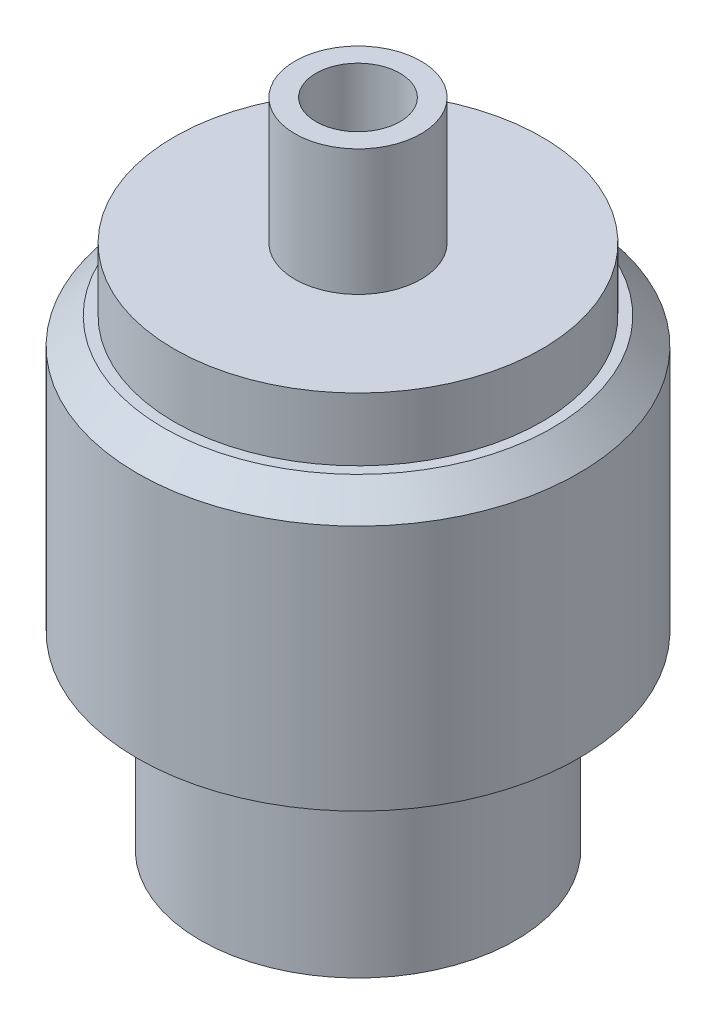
from build123d import *

# Parameters (mm, degrees)
SKICA1_R                   = 10.5
P_IDAT_VYSUNUT_M1_DEPTH    = 25
SKICA2_OUTSIDE_W           = 30.764
SKICA2_OUTSIDE_H           = 30.764
SKICA2_OUTSIDE_R           = 8.75
ODEBRAT_VYSUNUT_M1_DEPTH   = 3
SKICA3_R                   = 3
P_IDAT_VYSUNUT_M2_DEPTH    = 6
SKICA4_OUTSIDE_W           = 31.586
SKICA4_OUTSIDE_H           = 31.586
SKICA4_OUTSIDE_R           = 7.5
ODEBRAT_VYSUNUT_M2_DEPTH   = 7.5
ZKOSEN_1_SIZE              = 1.5
ZKOSEN_1_SIZE2             = 2.5
ZKOSEN_2_SIZE              = 1.25
F_7_0_7_PR_M_R_D_RY1_D     = 7
F_7_0_7_PR_M_R_D_RY1_DEPTH = 20
F_7_0_7_PR_M_R_D_RY1_TIP   = 2.020725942
SKICA7_R                   = 2
ODEBRAT_VYSUNUT_M3_DEPTH   = 35.372954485


with BuildPart() as part:
    # Skica1 → P_idat vysunut_m1 (new body)
    with BuildSketch(Plane(origin=(0, 0, 0), x_dir=(1, 0, 0), z_dir=(0, 1, 0))):
        with Locations(Location((0, 0, 0), (0, 0, 270))):
            Circle(SKICA1_R)
    extrude(amount=P_IDAT_VYSUNUT_M1_DEPTH)

    # Skica2 outside → Odebrat vysunut_m1 (cut)
    with BuildSketch(Plane(origin=(0, 25, 0), x_dir=(1, 0, 0), z_dir=(0, 1, 0))):
        Rectangle(SKICA2_OUTSIDE_W, SKICA2_OUTSIDE_H)
        with Locations(Location((0, 0, 0), (0, 0, 270))):
            Circle(SKICA2_OUTSIDE_R, mode=Mode.SUBTRACT)
    extrude(amount=-ODEBRAT_VYSUNUT_M1_DEPTH, mode=Mode.SUBTRACT)

    # Skica3 → P_idat vysunut_m2 (add)
    with BuildSketch(Plane(origin=(0, 25, 0), x_dir=(1, 0, 0), z_dir=(0, 1, 0))):
        with Locations(Location((0, 0, 0), (0, 0, 270))):
            Circle(SKICA3_R)
    extrude(amount=P_IDAT_VYSUNUT_M2_DEPTH)

    # Skica4 outside → Odebrat vysunut_m2 (cut)
    with BuildSketch(Plane.XZ):
        Rectangle(SKICA4_OUTSIDE_W, SKICA4_OUTSIDE_H)
        with Locations(Location((0, 0, 0), (0, 0, 270))):
            Circle(SKICA4_OUTSIDE_R, mode=Mode.SUBTRACT)
    extrude(amount=-ODEBRAT_VYSUNUT_M2_DEPTH, mode=Mode.SUBTRACT)

    # Zkosen_1
    zkosen_1_edges = [part.edges().sort_by_distance(p)[0] for p in [
        (0, 7.5, -10.5),
    ]]
    zkosen_1_side = [part.faces().sort_by_distance(p)[0] for p in [
        (0, 14.75, -10.5),
    ]]
    chamfer(zkosen_1_edges, length=ZKOSEN_1_SIZE, length2=ZKOSEN_1_SIZE2, reference=zkosen_1_side[0])

    # Zkosen_2
    zkosen_2_edges = [part.edges().sort_by_distance(p)[0] for p in [
        (0, 22, -10.5),
    ]]
    chamfer(zkosen_2_edges, length=ZKOSEN_2_SIZE)

    # 7.0 _7_ pr_m_r d_ry1
    with Locations(Plane.XZ):
        with Locations((0, 0)):
            Hole(F_7_0_7_PR_M_R_D_RY1_D / 2, depth=F_7_0_7_PR_M_R_D_RY1_DEPTH)
            with Locations((0, 0, -(F_7_0_7_PR_M_R_D_RY1_DEPTH + F_7_0_7_PR_M_R_D_RY1_TIP / 2))):  # 120° drill point
                Cone(0, F_7_0_7_PR_M_R_D_RY1_D / 2, F_7_0_7_PR_M_R_D_RY1_TIP, mode=Mode.SUBTRACT)

    # Skica7 → Odebrat vysunut_m3 (cut, through all)
    with BuildSketch(Plane(origin=(0, 31, 0), x_dir=(1, 0, 0), z_dir=(0, 1, 0))):
        with Locations(Location((0, 0, 0), (0, 0, 270))):
            Circle(SKICA7_R)
    extrude(amount=-ODEBRAT_VYSUNUT_M3_DEPTH, mode=Mode.SUBTRACT)


solid = part.part
